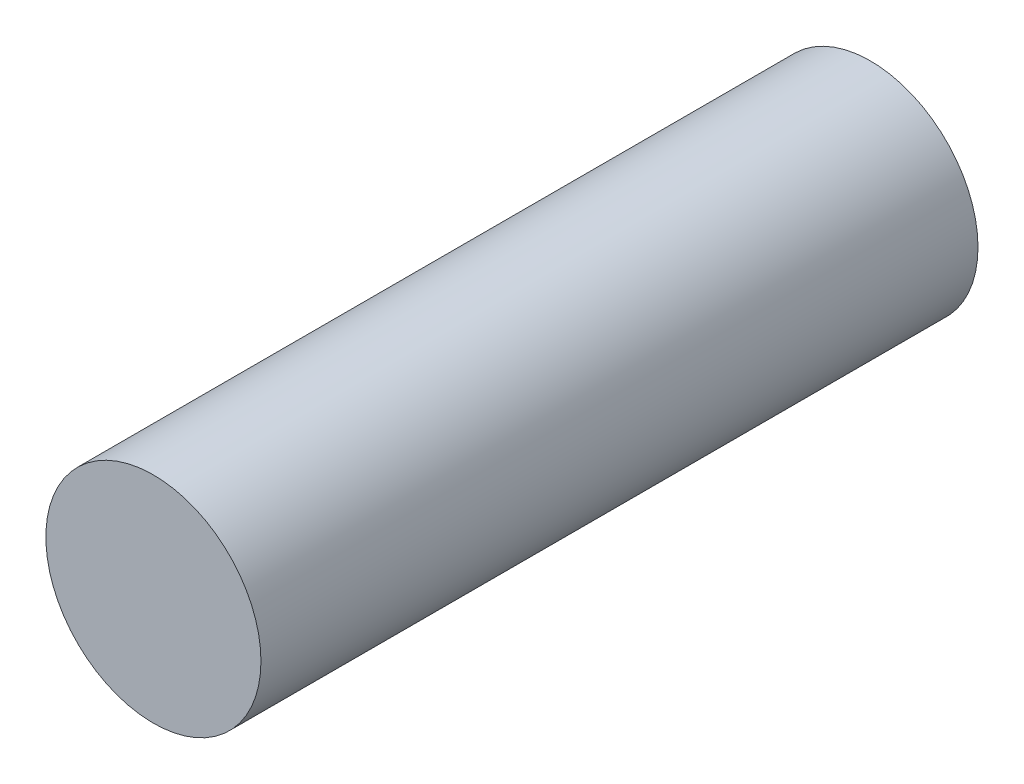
from build123d import *

# Parameters (mm, degrees)
ESQUISSE1_R        = 0.75
BOSS_EXTRU_1_DEPTH = 5


with BuildPart() as part:
    # Esquisse1 → Boss.-Extru.1 (new body)
    with BuildSketch(Plane.XY):
        Circle(ESQUISSE1_R)
    extrude(amount=BOSS_EXTRU_1_DEPTH)


solid = part.part
